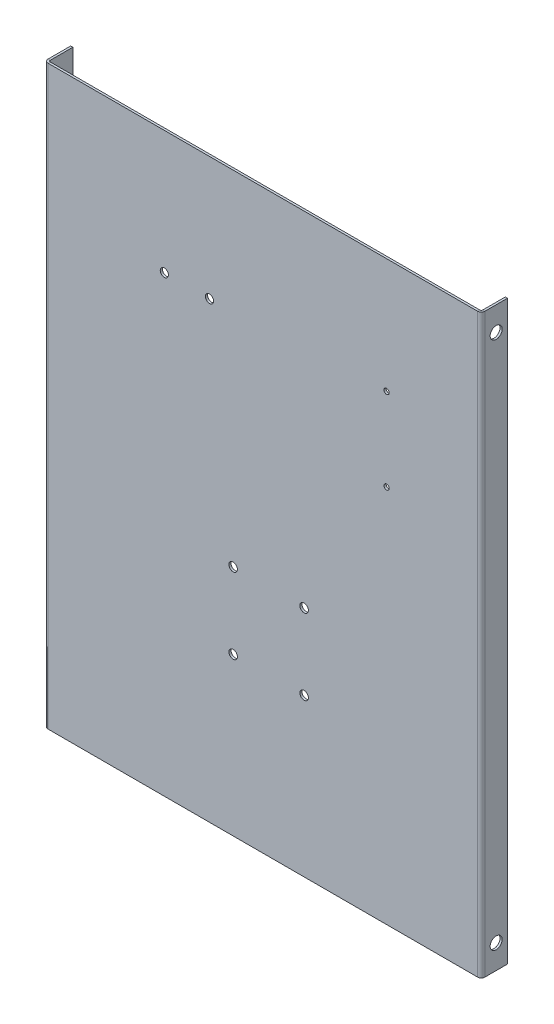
ISO-10303-21;
HEADER;
FILE_DESCRIPTION(('STEP AP214'),'2;1');
FILE_NAME('part.step','',(''),(''),'','','');
FILE_SCHEMA(('AUTOMOTIVE_DESIGN { 1 0 10303 214 1 1 1 1 }'));
ENDSEC;
DATA;
#1=APPLICATION_CONTEXT('core data for automotive mechanical design processes');
#2=APPLICATION_PROTOCOL_DEFINITION('international standard','automotive_design',2000,#1);
#3=PRODUCT_CONTEXT('',#1,'mechanical');
#4=PRODUCT('Part','Part','',(#3));
#5=PRODUCT_RELATED_PRODUCT_CATEGORY('part','',(#4));
#6=PRODUCT_DEFINITION_FORMATION('','',#4);
#7=PRODUCT_DEFINITION_CONTEXT('part definition',#1,'design');
#8=PRODUCT_DEFINITION('design','',#6,#7);
#9=PRODUCT_DEFINITION_SHAPE('','',#8);
#10=(LENGTH_UNIT() NAMED_UNIT(*) SI_UNIT(.MILLI.,.METRE.));
#11=(NAMED_UNIT(*) PLANE_ANGLE_UNIT() SI_UNIT($,.RADIAN.));
#12=(NAMED_UNIT(*) SI_UNIT($,.STERADIAN.) SOLID_ANGLE_UNIT());
#13=UNCERTAINTY_MEASURE_WITH_UNIT(LENGTH_MEASURE(1.E-05),#10,'distance_accuracy_value','');
#14=(GEOMETRIC_REPRESENTATION_CONTEXT(3) GLOBAL_UNCERTAINTY_ASSIGNED_CONTEXT((#13)) GLOBAL_UNIT_ASSIGNED_CONTEXT((#10,
#11,#12)) REPRESENTATION_CONTEXT('',''));
#15=CARTESIAN_POINT('',(0.,0.,0.));
#16=DIRECTION('',(0.,0.,1.));
#17=DIRECTION('',(1.,0.,0.));
#18=AXIS2_PLACEMENT_3D('',#15,#16,#17);
#19=CARTESIAN_POINT('',(230.886,304.8,0.));
#20=DIRECTION('',(-1.,0.,0.));
#21=DIRECTION('',(0.,0.,1.));
#22=AXIS2_PLACEMENT_3D('',#19,#20,#21);
#23=PLANE('',#22);
#24=CARTESIAN_POINT('',(230.886,279.4,-13.462));
#25=DIRECTION('',(1.,0.,0.));
#26=DIRECTION('',(0.,0.,-1.));
#27=AXIS2_PLACEMENT_3D('',#24,#25,#26);
#28=CIRCLE('',#27,6.35);
#29=CARTESIAN_POINT('',(230.886,279.4,-19.812));
#30=VERTEX_POINT('',#29);
#31=EDGE_CURVE('E327',#30,#30,#28,.T.);
#32=ORIENTED_EDGE('',*,*,#31,.F.);
#33=EDGE_LOOP('',(#32));
#34=FACE_BOUND('',#33,.T.);
#35=DIRECTION('',(0.,0.,-1.));
#36=VECTOR('',#35,1.);
#37=CARTESIAN_POINT('',(230.886,-304.8,0.));
#38=LINE('',#37,#36);
#39=CARTESIAN_POINT('',(230.886,-304.8,-1.52400000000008));
#40=VERTEX_POINT('',#39);
#41=CARTESIAN_POINT('',(230.886,-304.8,-25.4000000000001));
#42=VERTEX_POINT('',#41);
#43=EDGE_CURVE('E174',#40,#42,#38,.T.);
#44=ORIENTED_EDGE('',*,*,#43,.T.);
#45=DIRECTION('',(0.,-1.,0.));
#46=VECTOR('',#45,1.);
#47=CARTESIAN_POINT('',(230.886,304.8,-25.4000000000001));
#48=LINE('',#47,#46);
#49=CARTESIAN_POINT('',(230.886,304.8,-25.4000000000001));
#50=VERTEX_POINT('',#49);
#51=EDGE_CURVE('E227',#50,#42,#48,.T.);
#52=ORIENTED_EDGE('',*,*,#51,.F.);
#53=DIRECTION('',(0.,0.,-1.));
#54=VECTOR('',#53,1.);
#55=CARTESIAN_POINT('',(230.886,304.8,0.));
#56=LINE('',#55,#54);
#57=CARTESIAN_POINT('',(230.886,304.8,-1.52400000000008));
#58=VERTEX_POINT('',#57);
#59=EDGE_CURVE('E109',#58,#50,#56,.T.);
#60=ORIENTED_EDGE('',*,*,#59,.F.);
#61=DIRECTION('',(0.,-1.,0.));
#62=VECTOR('',#61,1.);
#63=CARTESIAN_POINT('',(230.886,304.8,-1.52400000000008));
#64=LINE('',#63,#62);
#65=EDGE_CURVE('E170',#58,#40,#64,.T.);
#66=ORIENTED_EDGE('',*,*,#65,.T.);
#67=EDGE_LOOP('',(#44,#52,#60,#66));
#68=FACE_BOUND('',#67,.T.);
#69=CARTESIAN_POINT('',(230.886,-279.4,-13.4620000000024));
#70=DIRECTION('',(1.,0.,0.));
#71=DIRECTION('',(0.,0.,1.));
#72=AXIS2_PLACEMENT_3D('',#69,#70,#71);
#73=CIRCLE('',#72,6.34999999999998);
#74=CARTESIAN_POINT('',(230.886,-279.4,-7.11200000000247));
#75=VERTEX_POINT('',#74);
#76=EDGE_CURVE('E333',#75,#75,#73,.T.);
#77=ORIENTED_EDGE('',*,*,#76,.F.);
#78=EDGE_LOOP('',(#77));
#79=FACE_BOUND('',#78,.T.);
#80=ADVANCED_FACE('F38',(#34,#68,#79),#23,.F.);
#81=CARTESIAN_POINT('',(228.6,304.8,0.));
#82=DIRECTION('',(-1.,0.,0.));
#83=DIRECTION('',(0.,0.,1.));
#84=AXIS2_PLACEMENT_3D('',#81,#82,#83);
#85=PLANE('',#84);
#86=CARTESIAN_POINT('',(228.6,279.4,-13.462));
#87=DIRECTION('',(1.,0.,0.));
#88=DIRECTION('',(0.,0.,-1.));
#89=AXIS2_PLACEMENT_3D('',#86,#87,#88);
#90=CIRCLE('',#89,6.35);
#91=CARTESIAN_POINT('',(228.6,279.4,-19.812));
#92=VERTEX_POINT('',#91);
#93=EDGE_CURVE('E330',#92,#92,#90,.T.);
#94=ORIENTED_EDGE('',*,*,#93,.T.);
#95=EDGE_LOOP('',(#94));
#96=FACE_BOUND('',#95,.T.);
#97=DIRECTION('',(0.,0.,-1.));
#98=VECTOR('',#97,1.);
#99=CARTESIAN_POINT('',(228.6,-304.8,0.));
#100=LINE('',#99,#98);
#101=CARTESIAN_POINT('',(228.6,-304.8,-1.52400000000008));
#102=VERTEX_POINT('',#101);
#103=CARTESIAN_POINT('',(228.6,-304.8,-25.4000000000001));
#104=VERTEX_POINT('',#103);
#105=EDGE_CURVE('E181',#102,#104,#100,.T.);
#106=ORIENTED_EDGE('',*,*,#105,.F.);
#107=DIRECTION('',(0.,-1.,0.));
#108=VECTOR('',#107,1.);
#109=CARTESIAN_POINT('',(228.6,304.8,-1.52400000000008));
#110=LINE('',#109,#108);
#111=CARTESIAN_POINT('',(228.6,304.8,-1.52400000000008));
#112=VERTEX_POINT('',#111);
#113=EDGE_CURVE('E222',#112,#102,#110,.T.);
#114=ORIENTED_EDGE('',*,*,#113,.F.);
#115=DIRECTION('',(0.,0.,-1.));
#116=VECTOR('',#115,1.);
#117=CARTESIAN_POINT('',(228.6,304.8,0.));
#118=LINE('',#117,#116);
#119=CARTESIAN_POINT('',(228.6,304.8,-25.4000000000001));
#120=VERTEX_POINT('',#119);
#121=EDGE_CURVE('E263',#112,#120,#118,.T.);
#122=ORIENTED_EDGE('',*,*,#121,.T.);
#123=DIRECTION('',(0.,-1.,0.));
#124=VECTOR('',#123,1.);
#125=CARTESIAN_POINT('',(228.6,304.8,-25.4000000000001));
#126=LINE('',#125,#124);
#127=EDGE_CURVE('E225',#120,#104,#126,.T.);
#128=ORIENTED_EDGE('',*,*,#127,.T.);
#129=EDGE_LOOP('',(#106,#114,#122,#128));
#130=FACE_BOUND('',#129,.T.);
#131=CARTESIAN_POINT('',(228.6,-279.4,-13.4620000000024));
#132=DIRECTION('',(1.,0.,0.));
#133=DIRECTION('',(0.,0.,1.));
#134=AXIS2_PLACEMENT_3D('',#131,#132,#133);
#135=CIRCLE('',#134,6.34999999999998);
#136=CARTESIAN_POINT('',(228.6,-279.4,-7.11200000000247));
#137=VERTEX_POINT('',#136);
#138=EDGE_CURVE('E336',#137,#137,#135,.T.);
#139=ORIENTED_EDGE('',*,*,#138,.T.);
#140=EDGE_LOOP('',(#139));
#141=FACE_BOUND('',#140,.T.);
#142=ADVANCED_FACE('F346',(#96,#130,#141),#85,.T.);
#143=CARTESIAN_POINT('',(-227.076,304.8,0.));
#144=DIRECTION('',(0.,1.,0.));
#145=DIRECTION('',(0.,0.,1.));
#146=AXIS2_PLACEMENT_3D('',#143,#144,#145);
#147=PLANE('',#146);
#148=DIRECTION('',(0.,0.,1.));
#149=VECTOR('',#148,1.);
#150=CARTESIAN_POINT('',(-227.076,304.8,0.));
#151=LINE('',#150,#149);
#152=CARTESIAN_POINT('',(-227.076,304.8,0.));
#153=VERTEX_POINT('',#152);
#154=CARTESIAN_POINT('',(-227.076,304.8,2.286));
#155=VERTEX_POINT('',#154);
#156=EDGE_CURVE('E11',#153,#155,#151,.T.);
#157=ORIENTED_EDGE('',*,*,#156,.F.);
#158=CARTESIAN_POINT('',(-227.076,304.8,-1.524));
#159=DIRECTION('',(0.,-1.,0.));
#160=DIRECTION('',(0.,0.,-1.));
#161=AXIS2_PLACEMENT_3D('',#158,#159,#160);
#162=CIRCLE('',#161,1.524);
#163=CARTESIAN_POINT('',(-228.6,304.8,-1.524));
#164=VERTEX_POINT('',#163);
#165=EDGE_CURVE('E250',#164,#153,#162,.F.);
#166=ORIENTED_EDGE('',*,*,#165,.F.);
#167=DIRECTION('',(1.,0.,0.));
#168=VECTOR('',#167,1.);
#169=CARTESIAN_POINT('',(-230.886,304.8,-1.524));
#170=LINE('',#169,#168);
#171=CARTESIAN_POINT('',(-230.886,304.8,-1.524));
#172=VERTEX_POINT('',#171);
#173=EDGE_CURVE('E47',#172,#164,#170,.T.);
#174=ORIENTED_EDGE('',*,*,#173,.F.);
#175=CARTESIAN_POINT('',(-227.076,304.8,-1.524));
#176=DIRECTION('',(0.,1.,0.));
#177=DIRECTION('',(1.,0.,0.));
#178=AXIS2_PLACEMENT_3D('',#175,#176,#177);
#179=CIRCLE('',#178,3.81);
#180=EDGE_CURVE('E148',#172,#155,#179,.T.);
#181=ORIENTED_EDGE('',*,*,#180,.T.);
#182=EDGE_LOOP('',(#157,#166,#174,#181));
#183=FACE_BOUND('',#182,.T.);
#184=ADVANCED_FACE('F40',(#183),#147,.T.);
#185=CARTESIAN_POINT('',(-230.886,304.8,-1.524));
#186=DIRECTION('',(0.,1.,0.));
#187=DIRECTION('',(0.,0.,1.));
#188=AXIS2_PLACEMENT_3D('',#185,#186,#187);
#189=PLANE('',#188);
#190=DIRECTION('',(1.,0.,0.));
#191=VECTOR('',#190,1.);
#192=CARTESIAN_POINT('',(-228.6,304.8,0.));
#193=LINE('',#192,#191);
#194=CARTESIAN_POINT('',(227.076,304.8,0.));
#195=VERTEX_POINT('',#194);
#196=EDGE_CURVE('E142',#153,#195,#193,.T.);
#197=ORIENTED_EDGE('',*,*,#196,.F.);
#198=ORIENTED_EDGE('',*,*,#156,.T.);
#199=DIRECTION('',(1.,0.,0.));
#200=VECTOR('',#199,1.);
#201=CARTESIAN_POINT('',(-228.6,304.8,2.286));
#202=LINE('',#201,#200);
#203=CARTESIAN_POINT('',(227.076,304.8,2.28599999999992));
#204=VERTEX_POINT('',#203);
#205=EDGE_CURVE('E139',#155,#204,#202,.T.);
#206=ORIENTED_EDGE('',*,*,#205,.T.);
#207=DIRECTION('',(0.,0.,-1.));
#208=VECTOR('',#207,1.);
#209=CARTESIAN_POINT('',(227.076,304.8,2.28599999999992));
#210=LINE('',#209,#208);
#211=EDGE_CURVE('E231',#204,#195,#210,.T.);
#212=ORIENTED_EDGE('',*,*,#211,.T.);
#213=EDGE_LOOP('',(#197,#198,#206,#212));
#214=FACE_BOUND('',#213,.T.);
#215=ADVANCED_FACE('F137',(#214),#189,.T.);
#216=CARTESIAN_POINT('',(-228.6,-304.8,-1.524));
#217=DIRECTION('',(0.,-1.,0.));
#218=DIRECTION('',(0.,0.,-1.));
#219=AXIS2_PLACEMENT_3D('',#216,#217,#218);
#220=PLANE('',#219);
#221=DIRECTION('',(-1.,0.,0.));
#222=VECTOR('',#221,1.);
#223=CARTESIAN_POINT('',(-228.6,-304.8,-1.524));
#224=LINE('',#223,#222);
#225=CARTESIAN_POINT('',(-228.6,-304.8,-1.524));
#226=VERTEX_POINT('',#225);
#227=CARTESIAN_POINT('',(-230.886,-304.8,-1.524));
#228=VERTEX_POINT('',#227);
#229=EDGE_CURVE('E236',#226,#228,#224,.T.);
#230=ORIENTED_EDGE('',*,*,#229,.F.);
#231=CARTESIAN_POINT('',(-227.076,-304.8,-1.524));
#232=DIRECTION('',(0.,-1.,0.));
#233=DIRECTION('',(0.,0.,-1.));
#234=AXIS2_PLACEMENT_3D('',#231,#232,#233);
#235=CIRCLE('',#234,1.524);
#236=CARTESIAN_POINT('',(-227.076,-304.8,0.));
#237=VERTEX_POINT('',#236);
#238=EDGE_CURVE('E188',#226,#237,#235,.F.);
#239=ORIENTED_EDGE('',*,*,#238,.T.);
#240=DIRECTION('',(0.,0.,-1.));
#241=VECTOR('',#240,1.);
#242=CARTESIAN_POINT('',(-227.076,-304.8,2.286));
#243=LINE('',#242,#241);
#244=CARTESIAN_POINT('',(-227.076,-304.8,2.286));
#245=VERTEX_POINT('',#244);
#246=EDGE_CURVE('E234',#245,#237,#243,.T.);
#247=ORIENTED_EDGE('',*,*,#246,.F.);
#248=CARTESIAN_POINT('',(-227.076,-304.8,-1.524));
#249=DIRECTION('',(0.,1.,0.));
#250=DIRECTION('',(1.,0.,0.));
#251=AXIS2_PLACEMENT_3D('',#248,#249,#250);
#252=CIRCLE('',#251,3.81);
#253=EDGE_CURVE('E160',#228,#245,#252,.T.);
#254=ORIENTED_EDGE('',*,*,#253,.F.);
#255=EDGE_LOOP('',(#230,#239,#247,#254));
#256=FACE_BOUND('',#255,.T.);
#257=ADVANCED_FACE('F375',(#256),#220,.T.);
#258=CARTESIAN_POINT('',(-227.076,-304.8,2.286));
#259=DIRECTION('',(0.,-1.,0.));
#260=DIRECTION('',(0.,0.,-1.));
#261=AXIS2_PLACEMENT_3D('',#258,#259,#260);
#262=PLANE('',#261);
#263=DIRECTION('',(0.,0.,1.));
#264=VECTOR('',#263,1.);
#265=CARTESIAN_POINT('',(-228.6,-304.8,0.));
#266=LINE('',#265,#264);
#267=CARTESIAN_POINT('',(-228.6,-304.8,-25.4));
#268=VERTEX_POINT('',#267);
#269=EDGE_CURVE('E191',#268,#226,#266,.T.);
#270=ORIENTED_EDGE('',*,*,#269,.T.);
#271=ORIENTED_EDGE('',*,*,#229,.T.);
#272=DIRECTION('',(0.,0.,-1.));
#273=VECTOR('',#272,1.);
#274=CARTESIAN_POINT('',(-230.886,-304.8,0.));
#275=LINE('',#274,#273);
#276=CARTESIAN_POINT('',(-230.886,-304.8,-25.4));
#277=VERTEX_POINT('',#276);
#278=EDGE_CURVE('E197',#277,#228,#275,.F.);
#279=ORIENTED_EDGE('',*,*,#278,.F.);
#280=DIRECTION('',(1.,0.,0.));
#281=VECTOR('',#280,1.);
#282=CARTESIAN_POINT('',(-230.886,-304.8,-25.4));
#283=LINE('',#282,#281);
#284=EDGE_CURVE('E194',#277,#268,#283,.T.);
#285=ORIENTED_EDGE('',*,*,#284,.T.);
#286=EDGE_LOOP('',(#270,#271,#279,#285));
#287=FACE_BOUND('',#286,.T.);
#288=ADVANCED_FACE('F371',(#287),#262,.T.);
#289=CARTESIAN_POINT('',(228.6,304.8,-1.52400000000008));
#290=DIRECTION('',(0.,1.,0.));
#291=DIRECTION('',(0.,0.,1.));
#292=AXIS2_PLACEMENT_3D('',#289,#290,#291);
#293=PLANE('',#292);
#294=DIRECTION('',(1.,0.,0.));
#295=VECTOR('',#294,1.);
#296=CARTESIAN_POINT('',(228.6,304.8,-1.52400000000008));
#297=LINE('',#296,#295);
#298=EDGE_CURVE('E55',#112,#58,#297,.T.);
#299=ORIENTED_EDGE('',*,*,#298,.F.);
#300=CARTESIAN_POINT('',(227.076,304.8,-1.52400000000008));
#301=DIRECTION('',(0.,-1.,0.));
#302=DIRECTION('',(0.,0.,-1.));
#303=AXIS2_PLACEMENT_3D('',#300,#301,#302);
#304=CIRCLE('',#303,1.524);
#305=EDGE_CURVE('E260',#195,#112,#304,.F.);
#306=ORIENTED_EDGE('',*,*,#305,.F.);
#307=ORIENTED_EDGE('',*,*,#211,.F.);
#308=CARTESIAN_POINT('',(227.076,304.8,-1.52400000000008));
#309=DIRECTION('',(0.,1.,0.));
#310=DIRECTION('',(1.,0.,0.));
#311=AXIS2_PLACEMENT_3D('',#308,#309,#310);
#312=CIRCLE('',#311,3.81);
#313=EDGE_CURVE('E168',#204,#58,#312,.T.);
#314=ORIENTED_EDGE('',*,*,#313,.T.);
#315=EDGE_LOOP('',(#299,#306,#307,#314));
#316=FACE_BOUND('',#315,.T.);
#317=ADVANCED_FACE('F368',(#316),#293,.T.);
#318=CARTESIAN_POINT('',(227.076,304.8,2.28599999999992));
#319=DIRECTION('',(0.,1.,0.));
#320=DIRECTION('',(0.,0.,1.));
#321=AXIS2_PLACEMENT_3D('',#318,#319,#320);
#322=PLANE('',#321);
#323=ORIENTED_EDGE('',*,*,#121,.F.);
#324=ORIENTED_EDGE('',*,*,#298,.T.);
#325=ORIENTED_EDGE('',*,*,#59,.T.);
#326=DIRECTION('',(1.,0.,0.));
#327=VECTOR('',#326,1.);
#328=CARTESIAN_POINT('',(228.6,304.8,-25.4000000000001));
#329=LINE('',#328,#327);
#330=EDGE_CURVE('E266',#120,#50,#329,.T.);
#331=ORIENTED_EDGE('',*,*,#330,.F.);
#332=EDGE_LOOP('',(#323,#324,#325,#331));
#333=FACE_BOUND('',#332,.T.);
#334=ADVANCED_FACE('F365',(#333),#322,.T.);
#335=CARTESIAN_POINT('',(227.076,-304.8,0.));
#336=DIRECTION('',(0.,-1.,0.));
#337=DIRECTION('',(0.,0.,-1.));
#338=AXIS2_PLACEMENT_3D('',#335,#336,#337);
#339=PLANE('',#338);
#340=DIRECTION('',(0.,0.,1.));
#341=VECTOR('',#340,1.);
#342=CARTESIAN_POINT('',(227.076,-304.8,0.));
#343=LINE('',#342,#341);
#344=CARTESIAN_POINT('',(227.076,-304.8,0.));
#345=VERTEX_POINT('',#344);
#346=CARTESIAN_POINT('',(227.076,-304.8,2.28599999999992));
#347=VERTEX_POINT('',#346);
#348=EDGE_CURVE('E96',#345,#347,#343,.T.);
#349=ORIENTED_EDGE('',*,*,#348,.F.);
#350=CARTESIAN_POINT('',(227.076,-304.8,-1.52400000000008));
#351=DIRECTION('',(0.,-1.,0.));
#352=DIRECTION('',(0.,0.,-1.));
#353=AXIS2_PLACEMENT_3D('',#350,#351,#352);
#354=CIRCLE('',#353,1.524);
#355=EDGE_CURVE('E184',#345,#102,#354,.F.);
#356=ORIENTED_EDGE('',*,*,#355,.T.);
#357=DIRECTION('',(-1.,0.,0.));
#358=VECTOR('',#357,1.);
#359=CARTESIAN_POINT('',(230.886,-304.8,-1.52400000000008));
#360=LINE('',#359,#358);
#361=EDGE_CURVE('E103',#40,#102,#360,.T.);
#362=ORIENTED_EDGE('',*,*,#361,.F.);
#363=CARTESIAN_POINT('',(227.076,-304.8,-1.52400000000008));
#364=DIRECTION('',(0.,1.,0.));
#365=DIRECTION('',(1.,0.,0.));
#366=AXIS2_PLACEMENT_3D('',#363,#364,#365);
#367=CIRCLE('',#366,3.81);
#368=EDGE_CURVE('E203',#347,#40,#367,.T.);
#369=ORIENTED_EDGE('',*,*,#368,.F.);
#370=EDGE_LOOP('',(#349,#356,#362,#369));
#371=FACE_BOUND('',#370,.T.);
#372=ADVANCED_FACE('F362',(#371),#339,.T.);
#373=CARTESIAN_POINT('',(230.886,-304.8,-1.52400000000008));
#374=DIRECTION('',(0.,-1.,0.));
#375=DIRECTION('',(0.,0.,-1.));
#376=AXIS2_PLACEMENT_3D('',#373,#374,#375);
#377=PLANE('',#376);
#378=DIRECTION('',(1.,0.,0.));
#379=VECTOR('',#378,1.);
#380=CARTESIAN_POINT('',(-228.6,-304.8,0.));
#381=LINE('',#380,#379);
#382=EDGE_CURVE('E186',#237,#345,#381,.T.);
#383=ORIENTED_EDGE('',*,*,#382,.T.);
#384=ORIENTED_EDGE('',*,*,#348,.T.);
#385=DIRECTION('',(1.,0.,0.));
#386=VECTOR('',#385,1.);
#387=CARTESIAN_POINT('',(-228.6,-304.8,2.286));
#388=LINE('',#387,#386);
#389=EDGE_CURVE('E201',#245,#347,#388,.T.);
#390=ORIENTED_EDGE('',*,*,#389,.F.);
#391=ORIENTED_EDGE('',*,*,#246,.T.);
#392=EDGE_LOOP('',(#383,#384,#390,#391));
#393=FACE_BOUND('',#392,.T.);
#394=ADVANCED_FACE('F359',(#393),#377,.T.);
#395=CARTESIAN_POINT('',(228.6,304.8,-25.4000000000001));
#396=DIRECTION('',(0.,0.,-1.));
#397=DIRECTION('',(-1.,0.,0.));
#398=AXIS2_PLACEMENT_3D('',#395,#396,#397);
#399=PLANE('',#398);
#400=DIRECTION('',(1.,0.,0.));
#401=VECTOR('',#400,1.);
#402=CARTESIAN_POINT('',(228.6,-304.8,-25.4000000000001));
#403=LINE('',#402,#401);
#404=EDGE_CURVE('E177',#104,#42,#403,.T.);
#405=ORIENTED_EDGE('',*,*,#404,.F.);
#406=ORIENTED_EDGE('',*,*,#127,.F.);
#407=ORIENTED_EDGE('',*,*,#330,.T.);
#408=ORIENTED_EDGE('',*,*,#51,.T.);
#409=EDGE_LOOP('',(#405,#406,#407,#408));
#410=FACE_BOUND('',#409,.T.);
#411=ADVANCED_FACE('F358',(#410),#399,.T.);
#412=CARTESIAN_POINT('',(227.076,304.8,-1.52400000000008));
#413=DIRECTION('',(0.,-1.,0.));
#414=DIRECTION('',(0.,0.,-1.));
#415=AXIS2_PLACEMENT_3D('',#412,#413,#414);
#416=CYLINDRICAL_SURFACE('',#415,1.524);
#417=ORIENTED_EDGE('',*,*,#355,.F.);
#418=DIRECTION('',(0.,-1.,0.));
#419=VECTOR('',#418,1.);
#420=CARTESIAN_POINT('',(227.076,304.8,0.));
#421=LINE('',#420,#419);
#422=EDGE_CURVE('E219',#195,#345,#421,.T.);
#423=ORIENTED_EDGE('',*,*,#422,.F.);
#424=ORIENTED_EDGE('',*,*,#305,.T.);
#425=ORIENTED_EDGE('',*,*,#113,.T.);
#426=EDGE_LOOP('',(#417,#423,#424,#425));
#427=FACE_BOUND('',#426,.T.);
#428=ADVANCED_FACE('F568',(#427),#416,.F.);
#429=CARTESIAN_POINT('',(-228.6,304.8,0.));
#430=DIRECTION('',(0.,0.,-1.));
#431=DIRECTION('',(-1.,0.,0.));
#432=AXIS2_PLACEMENT_3D('',#429,#430,#431);
#433=PLANE('',#432);
#434=CARTESIAN_POINT('',(-104.14,174.498,0.));
#435=DIRECTION('',(0.,0.,-1.));
#436=DIRECTION('',(-1.,0.,0.));
#437=AXIS2_PLACEMENT_3D('',#434,#435,#436);
#438=CIRCLE('',#437,4.31800000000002);
#439=CARTESIAN_POINT('',(-108.458,174.498,0.));
#440=VERTEX_POINT('',#439);
#441=EDGE_CURVE('E312',#440,#440,#438,.T.);
#442=ORIENTED_EDGE('',*,*,#441,.F.);
#443=EDGE_LOOP('',(#442));
#444=FACE_BOUND('',#443,.T.);
#445=CARTESIAN_POINT('',(-56.388,174.498,0.));
#446=DIRECTION('',(0.,0.,-1.));
#447=DIRECTION('',(-1.,0.,0.));
#448=AXIS2_PLACEMENT_3D('',#445,#446,#447);
#449=CIRCLE('',#448,4.318);
#450=CARTESIAN_POINT('',(-60.706,174.498,0.));
#451=VERTEX_POINT('',#450);
#452=EDGE_CURVE('E306',#451,#451,#449,.T.);
#453=ORIENTED_EDGE('',*,*,#452,.F.);
#454=EDGE_LOOP('',(#453));
#455=FACE_BOUND('',#454,.T.);
#456=CARTESIAN_POINT('',(130.786,95.8,0.));
#457=DIRECTION('',(0.,0.,1.));
#458=DIRECTION('',(1.,0.,0.));
#459=AXIS2_PLACEMENT_3D('',#456,#457,#458);
#460=CIRCLE('',#459,2.75000000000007);
#461=CARTESIAN_POINT('',(133.536,95.8,0.));
#462=VERTEX_POINT('',#461);
#463=EDGE_CURVE('E297',#462,#462,#460,.T.);
#464=ORIENTED_EDGE('',*,*,#463,.T.);
#465=EDGE_LOOP('',(#464));
#466=FACE_BOUND('',#465,.T.);
#467=CARTESIAN_POINT('',(130.786,183.3,0.));
#468=DIRECTION('',(0.,0.,1.));
#469=DIRECTION('',(1.,0.,0.));
#470=AXIS2_PLACEMENT_3D('',#467,#468,#469);
#471=CIRCLE('',#470,2.75000000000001);
#472=CARTESIAN_POINT('',(133.536,183.3,0.));
#473=VERTEX_POINT('',#472);
#474=EDGE_CURVE('E291',#473,#473,#471,.T.);
#475=ORIENTED_EDGE('',*,*,#474,.T.);
#476=EDGE_LOOP('',(#475));
#477=FACE_BOUND('',#476,.T.);
#478=CARTESIAN_POINT('',(-31.386,-138.5,0.));
#479=DIRECTION('',(0.,0.,1.));
#480=DIRECTION('',(1.,0.,0.));
#481=AXIS2_PLACEMENT_3D('',#478,#479,#480);
#482=CIRCLE('',#481,4.50000000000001);
#483=CARTESIAN_POINT('',(-26.886,-138.5,0.));
#484=VERTEX_POINT('',#483);
#485=EDGE_CURVE('E285',#484,#484,#482,.T.);
#486=ORIENTED_EDGE('',*,*,#485,.T.);
#487=EDGE_LOOP('',(#486));
#488=FACE_BOUND('',#487,.T.);
#489=CARTESIAN_POINT('',(43.614,-138.5,0.));
#490=DIRECTION('',(0.,0.,1.));
#491=DIRECTION('',(1.,0.,0.));
#492=AXIS2_PLACEMENT_3D('',#489,#490,#491);
#493=CIRCLE('',#492,4.5);
#494=CARTESIAN_POINT('',(48.114,-138.5,0.));
#495=VERTEX_POINT('',#494);
#496=EDGE_CURVE('E279',#495,#495,#493,.T.);
#497=ORIENTED_EDGE('',*,*,#496,.T.);
#498=EDGE_LOOP('',(#497));
#499=FACE_BOUND('',#498,.T.);
#500=CARTESIAN_POINT('',(-31.386,-58.5000000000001,0.));
#501=DIRECTION('',(0.,0.,1.));
#502=DIRECTION('',(1.,0.,0.));
#503=AXIS2_PLACEMENT_3D('',#500,#501,#502);
#504=CIRCLE('',#503,4.5);
#505=CARTESIAN_POINT('',(-26.886,-58.5000000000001,0.));
#506=VERTEX_POINT('',#505);
#507=EDGE_CURVE('E273',#506,#506,#504,.T.);
#508=ORIENTED_EDGE('',*,*,#507,.T.);
#509=EDGE_LOOP('',(#508));
#510=FACE_BOUND('',#509,.T.);
#511=CARTESIAN_POINT('',(43.614,-58.5000000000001,0.));
#512=DIRECTION('',(0.,0.,1.));
#513=DIRECTION('',(1.,0.,0.));
#514=AXIS2_PLACEMENT_3D('',#511,#512,#513);
#515=CIRCLE('',#514,4.5);
#516=CARTESIAN_POINT('',(48.114,-58.5000000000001,0.));
#517=VERTEX_POINT('',#516);
#518=EDGE_CURVE('E178',#517,#517,#515,.T.);
#519=ORIENTED_EDGE('',*,*,#518,.T.);
#520=EDGE_LOOP('',(#519));
#521=FACE_BOUND('',#520,.T.);
#522=ORIENTED_EDGE('',*,*,#382,.F.);
#523=DIRECTION('',(0.,-1.,0.));
#524=VECTOR('',#523,1.);
#525=CARTESIAN_POINT('',(-227.076,304.8,0.));
#526=LINE('',#525,#524);
#527=EDGE_CURVE('E216',#153,#237,#526,.T.);
#528=ORIENTED_EDGE('',*,*,#527,.F.);
#529=ORIENTED_EDGE('',*,*,#196,.T.);
#530=ORIENTED_EDGE('',*,*,#422,.T.);
#531=EDGE_LOOP('',(#522,#528,#529,#530));
#532=FACE_BOUND('',#531,.T.);
#533=ADVANCED_FACE('F561',(#444,#455,#466,#477,#488,#499,#510,#521,#532),#433,.T.);
#534=CARTESIAN_POINT('',(-227.076,304.8,-1.524));
#535=DIRECTION('',(0.,-1.,0.));
#536=DIRECTION('',(0.,0.,-1.));
#537=AXIS2_PLACEMENT_3D('',#534,#535,#536);
#538=CYLINDRICAL_SURFACE('',#537,1.524);
#539=ORIENTED_EDGE('',*,*,#238,.F.);
#540=DIRECTION('',(0.,-1.,0.));
#541=VECTOR('',#540,1.);
#542=CARTESIAN_POINT('',(-228.6,304.8,-1.524));
#543=LINE('',#542,#541);
#544=EDGE_CURVE('E213',#164,#226,#543,.T.);
#545=ORIENTED_EDGE('',*,*,#544,.F.);
#546=ORIENTED_EDGE('',*,*,#165,.T.);
#547=ORIENTED_EDGE('',*,*,#527,.T.);
#548=EDGE_LOOP('',(#539,#545,#546,#547));
#549=FACE_BOUND('',#548,.T.);
#550=ADVANCED_FACE('F249',(#549),#538,.F.);
#551=CARTESIAN_POINT('',(-228.6,304.8,0.));
#552=DIRECTION('',(1.,0.,0.));
#553=DIRECTION('',(0.,0.,-1.));
#554=AXIS2_PLACEMENT_3D('',#551,#552,#553);
#555=PLANE('',#554);
#556=CARTESIAN_POINT('',(-228.6,-279.4,-13.4620000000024));
#557=DIRECTION('',(1.,0.,0.));
#558=DIRECTION('',(0.,0.,1.));
#559=AXIS2_PLACEMENT_3D('',#556,#557,#558);
#560=CIRCLE('',#559,6.34999999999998);
#561=CARTESIAN_POINT('',(-228.6,-279.4,-7.11200000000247));
#562=VERTEX_POINT('',#561);
#563=EDGE_CURVE('E324',#562,#562,#560,.T.);
#564=ORIENTED_EDGE('',*,*,#563,.F.);
#565=EDGE_LOOP('',(#564));
#566=FACE_BOUND('',#565,.T.);
#567=CARTESIAN_POINT('',(-228.6,279.4,-13.462));
#568=DIRECTION('',(1.,0.,0.));
#569=DIRECTION('',(0.,0.,-1.));
#570=AXIS2_PLACEMENT_3D('',#567,#568,#569);
#571=CIRCLE('',#570,6.35);
#572=CARTESIAN_POINT('',(-228.6,279.4,-19.812));
#573=VERTEX_POINT('',#572);
#574=EDGE_CURVE('E318',#573,#573,#571,.T.);
#575=ORIENTED_EDGE('',*,*,#574,.F.);
#576=EDGE_LOOP('',(#575));
#577=FACE_BOUND('',#576,.T.);
#578=ORIENTED_EDGE('',*,*,#269,.F.);
#579=DIRECTION('',(0.,-1.,0.));
#580=VECTOR('',#579,1.);
#581=CARTESIAN_POINT('',(-228.6,304.8,-25.4));
#582=LINE('',#581,#580);
#583=CARTESIAN_POINT('',(-228.6,304.8,-25.4));
#584=VERTEX_POINT('',#583);
#585=EDGE_CURVE('E211',#584,#268,#582,.T.);
#586=ORIENTED_EDGE('',*,*,#585,.F.);
#587=DIRECTION('',(0.,0.,1.));
#588=VECTOR('',#587,1.);
#589=CARTESIAN_POINT('',(-228.6,304.8,0.));
#590=LINE('',#589,#588);
#591=EDGE_CURVE('E243',#584,#164,#590,.T.);
#592=ORIENTED_EDGE('',*,*,#591,.T.);
#593=ORIENTED_EDGE('',*,*,#544,.T.);
#594=EDGE_LOOP('',(#578,#586,#592,#593));
#595=FACE_BOUND('',#594,.T.);
#596=ADVANCED_FACE('F254',(#566,#577,#595),#555,.T.);
#597=CARTESIAN_POINT('',(-230.886,304.8,-25.4));
#598=DIRECTION('',(0.,0.,-1.));
#599=DIRECTION('',(-1.,0.,0.));
#600=AXIS2_PLACEMENT_3D('',#597,#598,#599);
#601=PLANE('',#600);
#602=ORIENTED_EDGE('',*,*,#284,.F.);
#603=DIRECTION('',(0.,-1.,0.));
#604=VECTOR('',#603,1.);
#605=CARTESIAN_POINT('',(-230.886,304.8,-25.4));
#606=LINE('',#605,#604);
#607=CARTESIAN_POINT('',(-230.886,304.8,-25.4));
#608=VERTEX_POINT('',#607);
#609=EDGE_CURVE('E209',#608,#277,#606,.T.);
#610=ORIENTED_EDGE('',*,*,#609,.F.);
#611=DIRECTION('',(1.,0.,0.));
#612=VECTOR('',#611,1.);
#613=CARTESIAN_POINT('',(-230.886,304.8,-25.4));
#614=LINE('',#613,#612);
#615=EDGE_CURVE('E255',#608,#584,#614,.T.);
#616=ORIENTED_EDGE('',*,*,#615,.T.);
#617=ORIENTED_EDGE('',*,*,#585,.T.);
#618=EDGE_LOOP('',(#602,#610,#616,#617));
#619=FACE_BOUND('',#618,.T.);
#620=ADVANCED_FACE('F541',(#619),#601,.T.);
#621=CARTESIAN_POINT('',(-230.886,304.8,0.));
#622=DIRECTION('',(1.,0.,0.));
#623=DIRECTION('',(0.,0.,-1.));
#624=AXIS2_PLACEMENT_3D('',#621,#622,#623);
#625=PLANE('',#624);
#626=CARTESIAN_POINT('',(-230.886,-279.4,-13.4620000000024));
#627=DIRECTION('',(1.,0.,0.));
#628=DIRECTION('',(0.,0.,1.));
#629=AXIS2_PLACEMENT_3D('',#626,#627,#628);
#630=CIRCLE('',#629,6.34999999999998);
#631=CARTESIAN_POINT('',(-230.886,-279.4,-7.11200000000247));
#632=VERTEX_POINT('',#631);
#633=EDGE_CURVE('E321',#632,#632,#630,.T.);
#634=ORIENTED_EDGE('',*,*,#633,.T.);
#635=EDGE_LOOP('',(#634));
#636=FACE_BOUND('',#635,.T.);
#637=CARTESIAN_POINT('',(-230.886,279.4,-13.462));
#638=DIRECTION('',(1.,0.,0.));
#639=DIRECTION('',(0.,0.,-1.));
#640=AXIS2_PLACEMENT_3D('',#637,#638,#639);
#641=CIRCLE('',#640,6.35);
#642=CARTESIAN_POINT('',(-230.886,279.4,-19.812));
#643=VERTEX_POINT('',#642);
#644=EDGE_CURVE('E315',#643,#643,#641,.T.);
#645=ORIENTED_EDGE('',*,*,#644,.T.);
#646=EDGE_LOOP('',(#645));
#647=FACE_BOUND('',#646,.T.);
#648=ORIENTED_EDGE('',*,*,#278,.T.);
#649=DIRECTION('',(0.,-1.,0.));
#650=VECTOR('',#649,1.);
#651=CARTESIAN_POINT('',(-230.886,304.8,-1.524));
#652=LINE('',#651,#650);
#653=EDGE_CURVE('E162',#172,#228,#652,.T.);
#654=ORIENTED_EDGE('',*,*,#653,.F.);
#655=DIRECTION('',(0.,0.,-1.));
#656=VECTOR('',#655,1.);
#657=CARTESIAN_POINT('',(-230.886,304.8,0.));
#658=LINE('',#657,#656);
#659=EDGE_CURVE('E153',#608,#172,#658,.F.);
#660=ORIENTED_EDGE('',*,*,#659,.F.);
#661=ORIENTED_EDGE('',*,*,#609,.T.);
#662=EDGE_LOOP('',(#648,#654,#660,#661));
#663=FACE_BOUND('',#662,.T.);
#664=ADVANCED_FACE('F534',(#636,#647,#663),#625,.F.);
#665=CARTESIAN_POINT('',(-227.076,304.8,-1.524));
#666=DIRECTION('',(0.,-1.,0.));
#667=DIRECTION('',(0.,0.,-1.));
#668=AXIS2_PLACEMENT_3D('',#665,#666,#667);
#669=CYLINDRICAL_SURFACE('',#668,3.81);
#670=ORIENTED_EDGE('',*,*,#253,.T.);
#671=DIRECTION('',(0.,-1.,0.));
#672=VECTOR('',#671,1.);
#673=CARTESIAN_POINT('',(-227.076,304.8,2.286));
#674=LINE('',#673,#672);
#675=EDGE_CURVE('E157',#155,#245,#674,.T.);
#676=ORIENTED_EDGE('',*,*,#675,.F.);
#677=ORIENTED_EDGE('',*,*,#180,.F.);
#678=ORIENTED_EDGE('',*,*,#653,.T.);
#679=EDGE_LOOP('',(#670,#676,#677,#678));
#680=FACE_BOUND('',#679,.T.);
#681=ADVANCED_FACE('F158',(#680),#669,.T.);
#682=CARTESIAN_POINT('',(-228.6,304.8,2.286));
#683=DIRECTION('',(0.,0.,-1.));
#684=DIRECTION('',(-1.,0.,0.));
#685=AXIS2_PLACEMENT_3D('',#682,#683,#684);
#686=PLANE('',#685);
#687=CARTESIAN_POINT('',(-104.14,174.498,2.28600000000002));
#688=DIRECTION('',(0.,0.,-1.));
#689=DIRECTION('',(-1.,0.,0.));
#690=AXIS2_PLACEMENT_3D('',#687,#688,#689);
#691=CIRCLE('',#690,4.31800000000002);
#692=CARTESIAN_POINT('',(-108.458,174.498,2.28600000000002));
#693=VERTEX_POINT('',#692);
#694=EDGE_CURVE('E309',#693,#693,#691,.T.);
#695=ORIENTED_EDGE('',*,*,#694,.T.);
#696=EDGE_LOOP('',(#695));
#697=FACE_BOUND('',#696,.T.);
#698=CARTESIAN_POINT('',(-56.388,174.498,2.28600000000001));
#699=DIRECTION('',(0.,0.,-1.));
#700=DIRECTION('',(-1.,0.,0.));
#701=AXIS2_PLACEMENT_3D('',#698,#699,#700);
#702=CIRCLE('',#701,4.318);
#703=CARTESIAN_POINT('',(-60.706,174.498,2.28600000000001));
#704=VERTEX_POINT('',#703);
#705=EDGE_CURVE('E303',#704,#704,#702,.T.);
#706=ORIENTED_EDGE('',*,*,#705,.T.);
#707=EDGE_LOOP('',(#706));
#708=FACE_BOUND('',#707,.T.);
#709=CARTESIAN_POINT('',(130.786,95.8,2.28599999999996));
#710=DIRECTION('',(0.,0.,1.));
#711=DIRECTION('',(1.,0.,0.));
#712=AXIS2_PLACEMENT_3D('',#709,#710,#711);
#713=CIRCLE('',#712,2.75000000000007);
#714=CARTESIAN_POINT('',(133.536,95.8,2.28599999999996));
#715=VERTEX_POINT('',#714);
#716=EDGE_CURVE('E300',#715,#715,#713,.T.);
#717=ORIENTED_EDGE('',*,*,#716,.F.);
#718=EDGE_LOOP('',(#717));
#719=FACE_BOUND('',#718,.T.);
#720=CARTESIAN_POINT('',(130.786,183.3,2.28599999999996));
#721=DIRECTION('',(0.,0.,1.));
#722=DIRECTION('',(1.,0.,0.));
#723=AXIS2_PLACEMENT_3D('',#720,#721,#722);
#724=CIRCLE('',#723,2.75000000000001);
#725=CARTESIAN_POINT('',(133.536,183.3,2.28599999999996));
#726=VERTEX_POINT('',#725);
#727=EDGE_CURVE('E294',#726,#726,#724,.T.);
#728=ORIENTED_EDGE('',*,*,#727,.F.);
#729=EDGE_LOOP('',(#728));
#730=FACE_BOUND('',#729,.T.);
#731=CARTESIAN_POINT('',(-31.386,-138.5,2.28599999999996));
#732=DIRECTION('',(0.,0.,1.));
#733=DIRECTION('',(1.,0.,0.));
#734=AXIS2_PLACEMENT_3D('',#731,#732,#733);
#735=CIRCLE('',#734,4.50000000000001);
#736=CARTESIAN_POINT('',(-26.886,-138.5,2.28599999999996));
#737=VERTEX_POINT('',#736);
#738=EDGE_CURVE('E288',#737,#737,#735,.T.);
#739=ORIENTED_EDGE('',*,*,#738,.F.);
#740=EDGE_LOOP('',(#739));
#741=FACE_BOUND('',#740,.T.);
#742=CARTESIAN_POINT('',(43.614,-138.5,2.28599999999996));
#743=DIRECTION('',(0.,0.,1.));
#744=DIRECTION('',(1.,0.,0.));
#745=AXIS2_PLACEMENT_3D('',#742,#743,#744);
#746=CIRCLE('',#745,4.5);
#747=CARTESIAN_POINT('',(48.114,-138.5,2.28599999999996));
#748=VERTEX_POINT('',#747);
#749=EDGE_CURVE('E282',#748,#748,#746,.T.);
#750=ORIENTED_EDGE('',*,*,#749,.F.);
#751=EDGE_LOOP('',(#750));
#752=FACE_BOUND('',#751,.T.);
#753=CARTESIAN_POINT('',(-31.386,-58.5000000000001,2.28599999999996));
#754=DIRECTION('',(0.,0.,1.));
#755=DIRECTION('',(1.,0.,0.));
#756=AXIS2_PLACEMENT_3D('',#753,#754,#755);
#757=CIRCLE('',#756,4.5);
#758=CARTESIAN_POINT('',(-26.886,-58.5000000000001,2.28599999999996));
#759=VERTEX_POINT('',#758);
#760=EDGE_CURVE('E276',#759,#759,#757,.T.);
#761=ORIENTED_EDGE('',*,*,#760,.F.);
#762=EDGE_LOOP('',(#761));
#763=FACE_BOUND('',#762,.T.);
#764=CARTESIAN_POINT('',(43.614,-58.5000000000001,2.28599999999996));
#765=DIRECTION('',(0.,0.,1.));
#766=DIRECTION('',(1.,0.,0.));
#767=AXIS2_PLACEMENT_3D('',#764,#765,#766);
#768=CIRCLE('',#767,4.5);
#769=CARTESIAN_POINT('',(48.114,-58.5000000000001,2.28599999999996));
#770=VERTEX_POINT('',#769);
#771=EDGE_CURVE('E270',#770,#770,#768,.T.);
#772=ORIENTED_EDGE('',*,*,#771,.F.);
#773=EDGE_LOOP('',(#772));
#774=FACE_BOUND('',#773,.T.);
#775=ORIENTED_EDGE('',*,*,#389,.T.);
#776=DIRECTION('',(0.,-1.,0.));
#777=VECTOR('',#776,1.);
#778=CARTESIAN_POINT('',(227.076,304.8,2.28599999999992));
#779=LINE('',#778,#777);
#780=EDGE_CURVE('E163',#204,#347,#779,.T.);
#781=ORIENTED_EDGE('',*,*,#780,.F.);
#782=ORIENTED_EDGE('',*,*,#205,.F.);
#783=ORIENTED_EDGE('',*,*,#675,.T.);
#784=EDGE_LOOP('',(#775,#781,#782,#783));
#785=FACE_BOUND('',#784,.T.);
#786=ADVANCED_FACE('F165',(#697,#708,#719,#730,#741,#752,#763,#774,#785),#686,.F.);
#787=CARTESIAN_POINT('',(227.076,304.8,-1.52400000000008));
#788=DIRECTION('',(0.,-1.,0.));
#789=DIRECTION('',(0.,0.,-1.));
#790=AXIS2_PLACEMENT_3D('',#787,#788,#789);
#791=CYLINDRICAL_SURFACE('',#790,3.81);
#792=ORIENTED_EDGE('',*,*,#368,.T.);
#793=ORIENTED_EDGE('',*,*,#65,.F.);
#794=ORIENTED_EDGE('',*,*,#313,.F.);
#795=ORIENTED_EDGE('',*,*,#780,.T.);
#796=EDGE_LOOP('',(#792,#793,#794,#795));
#797=FACE_BOUND('',#796,.T.);
#798=ADVANCED_FACE('F514',(#797),#791,.T.);
#799=CARTESIAN_POINT('',(227.076,304.8,-1.52400000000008));
#800=DIRECTION('',(0.,-1.,0.));
#801=DIRECTION('',(-1.,0.,0.));
#802=AXIS2_PLACEMENT_3D('',#799,#800,#801);
#803=PLANE('',#802);
#804=ORIENTED_EDGE('',*,*,#659,.T.);
#805=ORIENTED_EDGE('',*,*,#173,.T.);
#806=ORIENTED_EDGE('',*,*,#591,.F.);
#807=ORIENTED_EDGE('',*,*,#615,.F.);
#808=EDGE_LOOP('',(#804,#805,#806,#807));
#809=FACE_BOUND('',#808,.T.);
#810=ADVANCED_FACE('F240',(#809),#803,.F.);
#811=CARTESIAN_POINT('',(227.076,-304.8,-1.52400000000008));
#812=DIRECTION('',(0.,-1.,0.));
#813=DIRECTION('',(-1.,0.,0.));
#814=AXIS2_PLACEMENT_3D('',#811,#812,#813);
#815=PLANE('',#814);
#816=ORIENTED_EDGE('',*,*,#43,.F.);
#817=ORIENTED_EDGE('',*,*,#361,.T.);
#818=ORIENTED_EDGE('',*,*,#105,.T.);
#819=ORIENTED_EDGE('',*,*,#404,.T.);
#820=EDGE_LOOP('',(#816,#817,#818,#819));
#821=FACE_BOUND('',#820,.T.);
#822=ADVANCED_FACE('F499',(#821),#815,.T.);
#823=CARTESIAN_POINT('',(43.614,-58.5000000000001,0.));
#824=DIRECTION('',(0.,0.,1.));
#825=DIRECTION('',(1.,0.,0.));
#826=AXIS2_PLACEMENT_3D('',#823,#824,#825);
#827=CYLINDRICAL_SURFACE('',#826,4.5);
#828=ORIENTED_EDGE('',*,*,#518,.F.);
#829=EDGE_LOOP('',(#828));
#830=FACE_BOUND('',#829,.T.);
#831=ORIENTED_EDGE('',*,*,#771,.T.);
#832=EDGE_LOOP('',(#831));
#833=FACE_BOUND('',#832,.T.);
#834=ADVANCED_FACE('F491',(#830,#833),#827,.F.);
#835=CARTESIAN_POINT('',(-31.386,-58.5000000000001,0.));
#836=DIRECTION('',(0.,0.,1.));
#837=DIRECTION('',(1.,0.,0.));
#838=AXIS2_PLACEMENT_3D('',#835,#836,#837);
#839=CYLINDRICAL_SURFACE('',#838,4.5);
#840=ORIENTED_EDGE('',*,*,#507,.F.);
#841=EDGE_LOOP('',(#840));
#842=FACE_BOUND('',#841,.T.);
#843=ORIENTED_EDGE('',*,*,#760,.T.);
#844=EDGE_LOOP('',(#843));
#845=FACE_BOUND('',#844,.T.);
#846=ADVANCED_FACE('F483',(#842,#845),#839,.F.);
#847=CARTESIAN_POINT('',(43.614,-138.5,0.));
#848=DIRECTION('',(0.,0.,1.));
#849=DIRECTION('',(1.,0.,0.));
#850=AXIS2_PLACEMENT_3D('',#847,#848,#849);
#851=CYLINDRICAL_SURFACE('',#850,4.5);
#852=ORIENTED_EDGE('',*,*,#496,.F.);
#853=EDGE_LOOP('',(#852));
#854=FACE_BOUND('',#853,.T.);
#855=ORIENTED_EDGE('',*,*,#749,.T.);
#856=EDGE_LOOP('',(#855));
#857=FACE_BOUND('',#856,.T.);
#858=ADVANCED_FACE('F475',(#854,#857),#851,.F.);
#859=CARTESIAN_POINT('',(-31.386,-138.5,0.));
#860=DIRECTION('',(0.,0.,1.));
#861=DIRECTION('',(1.,0.,0.));
#862=AXIS2_PLACEMENT_3D('',#859,#860,#861);
#863=CYLINDRICAL_SURFACE('',#862,4.50000000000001);
#864=ORIENTED_EDGE('',*,*,#485,.F.);
#865=EDGE_LOOP('',(#864));
#866=FACE_BOUND('',#865,.T.);
#867=ORIENTED_EDGE('',*,*,#738,.T.);
#868=EDGE_LOOP('',(#867));
#869=FACE_BOUND('',#868,.T.);
#870=ADVANCED_FACE('F467',(#866,#869),#863,.F.);
#871=CARTESIAN_POINT('',(130.786,183.3,0.));
#872=DIRECTION('',(0.,0.,1.));
#873=DIRECTION('',(1.,0.,0.));
#874=AXIS2_PLACEMENT_3D('',#871,#872,#873);
#875=CYLINDRICAL_SURFACE('',#874,2.75000000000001);
#876=ORIENTED_EDGE('',*,*,#474,.F.);
#877=EDGE_LOOP('',(#876));
#878=FACE_BOUND('',#877,.T.);
#879=ORIENTED_EDGE('',*,*,#727,.T.);
#880=EDGE_LOOP('',(#879));
#881=FACE_BOUND('',#880,.T.);
#882=ADVANCED_FACE('F458',(#878,#881),#875,.F.);
#883=CARTESIAN_POINT('',(130.786,95.8,0.));
#884=DIRECTION('',(0.,0.,1.));
#885=DIRECTION('',(1.,0.,0.));
#886=AXIS2_PLACEMENT_3D('',#883,#884,#885);
#887=CYLINDRICAL_SURFACE('',#886,2.75000000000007);
#888=ORIENTED_EDGE('',*,*,#463,.F.);
#889=EDGE_LOOP('',(#888));
#890=FACE_BOUND('',#889,.T.);
#891=ORIENTED_EDGE('',*,*,#716,.T.);
#892=EDGE_LOOP('',(#891));
#893=FACE_BOUND('',#892,.T.);
#894=ADVANCED_FACE('F449',(#890,#893),#887,.F.);
#895=CARTESIAN_POINT('',(-56.388,174.498,2.28600000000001));
#896=DIRECTION('',(0.,0.,-1.));
#897=DIRECTION('',(-1.,0.,0.));
#898=AXIS2_PLACEMENT_3D('',#895,#896,#897);
#899=CYLINDRICAL_SURFACE('',#898,4.318);
#900=ORIENTED_EDGE('',*,*,#705,.F.);
#901=EDGE_LOOP('',(#900));
#902=FACE_BOUND('',#901,.T.);
#903=ORIENTED_EDGE('',*,*,#452,.T.);
#904=EDGE_LOOP('',(#903));
#905=FACE_BOUND('',#904,.T.);
#906=ADVANCED_FACE('F440',(#902,#905),#899,.F.);
#907=CARTESIAN_POINT('',(-104.14,174.498,2.28600000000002));
#908=DIRECTION('',(0.,0.,-1.));
#909=DIRECTION('',(-1.,0.,0.));
#910=AXIS2_PLACEMENT_3D('',#907,#908,#909);
#911=CYLINDRICAL_SURFACE('',#910,4.31800000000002);
#912=ORIENTED_EDGE('',*,*,#694,.F.);
#913=EDGE_LOOP('',(#912));
#914=FACE_BOUND('',#913,.T.);
#915=ORIENTED_EDGE('',*,*,#441,.T.);
#916=EDGE_LOOP('',(#915));
#917=FACE_BOUND('',#916,.T.);
#918=ADVANCED_FACE('F431',(#914,#917),#911,.F.);
#919=CARTESIAN_POINT('',(-230.886,279.4,-13.462));
#920=DIRECTION('',(1.,0.,0.));
#921=DIRECTION('',(0.,0.,-1.));
#922=AXIS2_PLACEMENT_3D('',#919,#920,#921);
#923=CYLINDRICAL_SURFACE('',#922,6.35);
#924=ORIENTED_EDGE('',*,*,#644,.F.);
#925=EDGE_LOOP('',(#924));
#926=FACE_BOUND('',#925,.T.);
#927=ORIENTED_EDGE('',*,*,#574,.T.);
#928=EDGE_LOOP('',(#927));
#929=FACE_BOUND('',#928,.T.);
#930=ADVANCED_FACE('F424',(#926,#929),#923,.F.);
#931=CARTESIAN_POINT('',(-230.886,-279.4,-13.4620000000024));
#932=DIRECTION('',(1.,0.,0.));
#933=DIRECTION('',(0.,0.,-1.));
#934=AXIS2_PLACEMENT_3D('',#931,#932,#933);
#935=CYLINDRICAL_SURFACE('',#934,6.34999999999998);
#936=ORIENTED_EDGE('',*,*,#633,.F.);
#937=EDGE_LOOP('',(#936));
#938=FACE_BOUND('',#937,.T.);
#939=ORIENTED_EDGE('',*,*,#563,.T.);
#940=EDGE_LOOP('',(#939));
#941=FACE_BOUND('',#940,.T.);
#942=ADVANCED_FACE('F405',(#938,#941),#935,.F.);
#943=CARTESIAN_POINT('',(230.886,279.4,-13.462));
#944=DIRECTION('',(-1.,0.,0.));
#945=DIRECTION('',(0.,0.,1.));
#946=AXIS2_PLACEMENT_3D('',#943,#944,#945);
#947=CYLINDRICAL_SURFACE('',#946,6.35);
#948=ORIENTED_EDGE('',*,*,#31,.T.);
#949=EDGE_LOOP('',(#948));
#950=FACE_BOUND('',#949,.T.);
#951=ORIENTED_EDGE('',*,*,#93,.F.);
#952=EDGE_LOOP('',(#951));
#953=FACE_BOUND('',#952,.T.);
#954=ADVANCED_FACE('F399',(#950,#953),#947,.F.);
#955=CARTESIAN_POINT('',(230.886,-279.4,-13.4620000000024));
#956=DIRECTION('',(-1.,0.,0.));
#957=DIRECTION('',(0.,0.,1.));
#958=AXIS2_PLACEMENT_3D('',#955,#956,#957);
#959=CYLINDRICAL_SURFACE('',#958,6.34999999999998);
#960=ORIENTED_EDGE('',*,*,#76,.T.);
#961=EDGE_LOOP('',(#960));
#962=FACE_BOUND('',#961,.T.);
#963=ORIENTED_EDGE('',*,*,#138,.F.);
#964=EDGE_LOOP('',(#963));
#965=FACE_BOUND('',#964,.T.);
#966=ADVANCED_FACE('F342',(#962,#965),#959,.F.);
#967=CLOSED_SHELL('',(#80,#142,#184,#215,#257,#288,#317,#334,#372,#394,#411,#428,#533,#550,#596,
#620,#664,#681,#786,#798,#810,#822,#834,#846,#858,#870,#882,#894,#906,#918,#930,#942,#954,#966));
#968=MANIFOLD_SOLID_BREP('B2',#967);
#969=ADVANCED_BREP_SHAPE_REPRESENTATION('',(#18,#968),#14);
#970=SHAPE_DEFINITION_REPRESENTATION(#9,#969);
ENDSEC;
END-ISO-10303-21;
